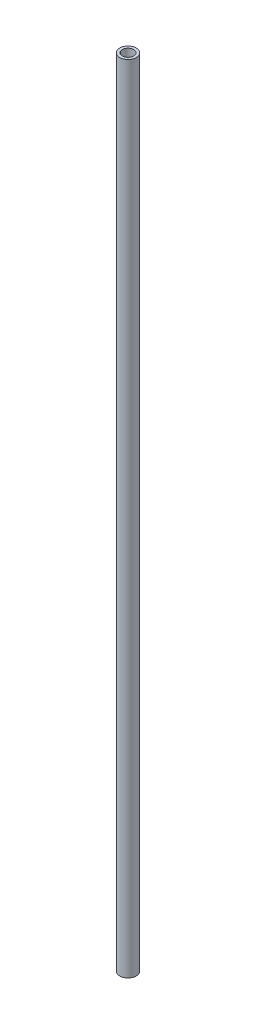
ISO-10303-21;
HEADER;
FILE_DESCRIPTION(('STEP AP214'),'2;1');
FILE_NAME('part.step','',(''),(''),'','','');
FILE_SCHEMA(('AUTOMOTIVE_DESIGN { 1 0 10303 214 1 1 1 1 }'));
ENDSEC;
DATA;
#1=APPLICATION_CONTEXT('core data for automotive mechanical design processes');
#2=APPLICATION_PROTOCOL_DEFINITION('international standard','automotive_design',2000,#1);
#3=PRODUCT_CONTEXT('',#1,'mechanical');
#4=PRODUCT('Part','Part','',(#3));
#5=PRODUCT_RELATED_PRODUCT_CATEGORY('part','',(#4));
#6=PRODUCT_DEFINITION_FORMATION('','',#4);
#7=PRODUCT_DEFINITION_CONTEXT('part definition',#1,'design');
#8=PRODUCT_DEFINITION('design','',#6,#7);
#9=PRODUCT_DEFINITION_SHAPE('','',#8);
#10=(LENGTH_UNIT() NAMED_UNIT(*) SI_UNIT(.MILLI.,.METRE.));
#11=(NAMED_UNIT(*) PLANE_ANGLE_UNIT() SI_UNIT($,.RADIAN.));
#12=(NAMED_UNIT(*) SI_UNIT($,.STERADIAN.) SOLID_ANGLE_UNIT());
#13=UNCERTAINTY_MEASURE_WITH_UNIT(LENGTH_MEASURE(1.E-05),#10,'distance_accuracy_value','');
#14=(GEOMETRIC_REPRESENTATION_CONTEXT(3) GLOBAL_UNCERTAINTY_ASSIGNED_CONTEXT((#13)) GLOBAL_UNIT_ASSIGNED_CONTEXT((#10,
#11,#12)) REPRESENTATION_CONTEXT('',''));
#15=CARTESIAN_POINT('',(0.,0.,0.));
#16=DIRECTION('',(0.,0.,1.));
#17=DIRECTION('',(1.,0.,0.));
#18=AXIS2_PLACEMENT_3D('',#15,#16,#17);
#19=CARTESIAN_POINT('',(0.,304.8,0.));
#20=DIRECTION('',(0.,1.,0.));
#21=DIRECTION('',(0.,0.,1.));
#22=AXIS2_PLACEMENT_3D('',#19,#20,#21);
#23=PLANE('',#22);
#24=CARTESIAN_POINT('',(0.,304.8,0.));
#25=DIRECTION('',(0.,1.,0.));
#26=DIRECTION('',(0.,0.,1.));
#27=AXIS2_PLACEMENT_3D('',#24,#25,#26);
#28=CIRCLE('',#27,3.17499999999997);
#29=CARTESIAN_POINT('',(0.,304.8,-3.17499999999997));
#30=VERTEX_POINT('',#29);
#31=EDGE_CURVE('E10',#30,#30,#28,.T.);
#32=ORIENTED_EDGE('',*,*,#31,.T.);
#33=EDGE_LOOP('',(#32));
#34=FACE_BOUND('',#33,.T.);
#35=CARTESIAN_POINT('',(0.,304.8,0.));
#36=DIRECTION('',(0.,1.,0.));
#37=DIRECTION('',(0.,0.,1.));
#38=AXIS2_PLACEMENT_3D('',#35,#36,#37);
#39=CIRCLE('',#38,2.15900000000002);
#40=CARTESIAN_POINT('',(0.,304.8,-2.15900000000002));
#41=VERTEX_POINT('',#40);
#42=EDGE_CURVE('E41',#41,#41,#39,.T.);
#43=ORIENTED_EDGE('',*,*,#42,.F.);
#44=EDGE_LOOP('',(#43));
#45=FACE_BOUND('',#44,.T.);
#46=ADVANCED_FACE('F30',(#34,#45),#23,.T.);
#47=CARTESIAN_POINT('',(0.,0.,0.));
#48=DIRECTION('',(0.,1.,0.));
#49=DIRECTION('',(0.,0.,1.));
#50=AXIS2_PLACEMENT_3D('',#47,#48,#49);
#51=PLANE('',#50);
#52=CARTESIAN_POINT('',(0.,0.,0.));
#53=DIRECTION('',(0.,1.,0.));
#54=DIRECTION('',(0.,0.,1.));
#55=AXIS2_PLACEMENT_3D('',#52,#53,#54);
#56=CIRCLE('',#55,3.17499999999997);
#57=CARTESIAN_POINT('',(0.,0.,-3.17499999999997));
#58=VERTEX_POINT('',#57);
#59=EDGE_CURVE('E34',#58,#58,#56,.T.);
#60=ORIENTED_EDGE('',*,*,#59,.F.);
#61=EDGE_LOOP('',(#60));
#62=FACE_BOUND('',#61,.T.);
#63=CARTESIAN_POINT('',(0.,0.,0.));
#64=DIRECTION('',(0.,1.,0.));
#65=DIRECTION('',(0.,0.,1.));
#66=AXIS2_PLACEMENT_3D('',#63,#64,#65);
#67=CIRCLE('',#66,2.15900000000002);
#68=CARTESIAN_POINT('',(0.,0.,-2.15900000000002));
#69=VERTEX_POINT('',#68);
#70=EDGE_CURVE('E43',#69,#69,#67,.T.);
#71=ORIENTED_EDGE('',*,*,#70,.T.);
#72=EDGE_LOOP('',(#71));
#73=FACE_BOUND('',#72,.T.);
#74=ADVANCED_FACE('F53',(#62,#73),#51,.F.);
#75=CARTESIAN_POINT('',(0.,304.8,0.));
#76=DIRECTION('',(0.,-1.,0.));
#77=DIRECTION('',(0.,0.,-1.));
#78=AXIS2_PLACEMENT_3D('',#75,#76,#77);
#79=CYLINDRICAL_SURFACE('',#78,3.17499999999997);
#80=CARTESIAN_POINT('',(0.,304.8,-3.17499999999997));
#81=CARTESIAN_POINT('',(0.,301.625,-3.17499999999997));
#82=CARTESIAN_POINT('',(0.,298.45,-3.17499999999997));
#83=CARTESIAN_POINT('',(0.,292.1,-3.17499999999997));
#84=CARTESIAN_POINT('',(0.,288.925,-3.17499999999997));
#85=CARTESIAN_POINT('',(0.,282.575,-3.17499999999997));
#86=CARTESIAN_POINT('',(0.,279.4,-3.17499999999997));
#87=CARTESIAN_POINT('',(0.,273.05,-3.17499999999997));
#88=CARTESIAN_POINT('',(0.,269.875,-3.17499999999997));
#89=CARTESIAN_POINT('',(0.,263.525,-3.17499999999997));
#90=CARTESIAN_POINT('',(0.,260.35,-3.17499999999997));
#91=CARTESIAN_POINT('',(0.,254.,-3.17499999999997));
#92=CARTESIAN_POINT('',(0.,250.825,-3.17499999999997));
#93=CARTESIAN_POINT('',(0.,244.475,-3.17499999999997));
#94=CARTESIAN_POINT('',(0.,241.3,-3.17499999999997));
#95=CARTESIAN_POINT('',(0.,234.95,-3.17499999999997));
#96=CARTESIAN_POINT('',(0.,231.775,-3.17499999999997));
#97=CARTESIAN_POINT('',(0.,225.425,-3.17499999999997));
#98=CARTESIAN_POINT('',(0.,222.25,-3.17499999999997));
#99=CARTESIAN_POINT('',(0.,215.9,-3.17499999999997));
#100=CARTESIAN_POINT('',(0.,212.725,-3.17499999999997));
#101=CARTESIAN_POINT('',(0.,206.375,-3.17499999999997));
#102=CARTESIAN_POINT('',(0.,203.2,-3.17499999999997));
#103=CARTESIAN_POINT('',(0.,196.85,-3.17499999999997));
#104=CARTESIAN_POINT('',(0.,193.675,-3.17499999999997));
#105=CARTESIAN_POINT('',(0.,187.325,-3.17499999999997));
#106=CARTESIAN_POINT('',(0.,184.15,-3.17499999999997));
#107=CARTESIAN_POINT('',(0.,177.8,-3.17499999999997));
#108=CARTESIAN_POINT('',(0.,174.625,-3.17499999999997));
#109=CARTESIAN_POINT('',(0.,168.275,-3.17499999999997));
#110=CARTESIAN_POINT('',(0.,165.1,-3.17499999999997));
#111=CARTESIAN_POINT('',(0.,158.75,-3.17499999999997));
#112=CARTESIAN_POINT('',(0.,155.575,-3.17499999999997));
#113=CARTESIAN_POINT('',(0.,149.225,-3.17499999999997));
#114=CARTESIAN_POINT('',(0.,146.05,-3.17499999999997));
#115=CARTESIAN_POINT('',(0.,139.7,-3.17499999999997));
#116=CARTESIAN_POINT('',(0.,136.525,-3.17499999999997));
#117=CARTESIAN_POINT('',(0.,130.175,-3.17499999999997));
#118=CARTESIAN_POINT('',(0.,127.,-3.17499999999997));
#119=CARTESIAN_POINT('',(0.,120.65,-3.17499999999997));
#120=CARTESIAN_POINT('',(0.,117.475,-3.17499999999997));
#121=CARTESIAN_POINT('',(0.,111.125,-3.17499999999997));
#122=CARTESIAN_POINT('',(0.,107.95,-3.17499999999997));
#123=CARTESIAN_POINT('',(0.,101.6,-3.17499999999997));
#124=CARTESIAN_POINT('',(0.,98.425,-3.17499999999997));
#125=CARTESIAN_POINT('',(0.,92.075,-3.17499999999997));
#126=CARTESIAN_POINT('',(0.,88.9,-3.17499999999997));
#127=CARTESIAN_POINT('',(0.,82.55,-3.17499999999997));
#128=CARTESIAN_POINT('',(0.,79.375,-3.17499999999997));
#129=CARTESIAN_POINT('',(0.,73.025,-3.17499999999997));
#130=CARTESIAN_POINT('',(0.,69.85,-3.17499999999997));
#131=CARTESIAN_POINT('',(0.,63.5,-3.17499999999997));
#132=CARTESIAN_POINT('',(0.,60.325,-3.17499999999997));
#133=CARTESIAN_POINT('',(0.,53.975,-3.17499999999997));
#134=CARTESIAN_POINT('',(0.,50.8,-3.17499999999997));
#135=CARTESIAN_POINT('',(0.,44.45,-3.17499999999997));
#136=CARTESIAN_POINT('',(0.,41.275,-3.17499999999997));
#137=CARTESIAN_POINT('',(0.,34.925,-3.17499999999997));
#138=CARTESIAN_POINT('',(0.,31.75,-3.17499999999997));
#139=CARTESIAN_POINT('',(0.,25.4,-3.17499999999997));
#140=CARTESIAN_POINT('',(0.,22.225,-3.17499999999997));
#141=CARTESIAN_POINT('',(0.,15.875,-3.17499999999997));
#142=CARTESIAN_POINT('',(0.,12.7,-3.17499999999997));
#143=CARTESIAN_POINT('',(0.,6.35,-3.17499999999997));
#144=CARTESIAN_POINT('',(0.,3.175,-3.17499999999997));
#145=CARTESIAN_POINT('',(0.,0.,-3.17499999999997));
#146=B_SPLINE_CURVE_WITH_KNOTS('',3,(#80,#81,#82,#83,#84,#85,#86,#87,#88,#89,#90,#91,#92,#93,
#94,#95,#96,#97,#98,#99,#100,#101,#102,#103,#104,#105,#106,#107,#108,#109,#110,#111,#112,#113,
#114,#115,#116,#117,#118,#119,#120,#121,#122,#123,#124,#125,#126,#127,#128,#129,#130,#131,#132,
#133,#134,#135,#136,#137,#138,#139,#140,#141,#142,#143,#144,#145),.UNSPECIFIED.,.F.,.F.,(4,2,2,
2,2,2,2,2,2,2,2,2,2,2,2,2,2,2,2,2,2,2,2,2,2,2,2,2,2,2,2,2,4),(0.,9.52499999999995,19.05,28.575,
38.1,47.625,57.15,66.675,76.2,85.725,95.2499999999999,104.775,114.3,123.825,133.35,142.875,
152.4,161.925,171.45,180.975,190.5,200.025,209.55,219.075,228.6,238.125,247.65,257.175,266.7,
276.225,285.75,295.275,304.8),.UNSPECIFIED.);
#147=EDGE_CURVE('BSEAM32',#30,#58,#146,.T.);
#148=ORIENTED_EDGE('',*,*,#31,.F.);
#149=ORIENTED_EDGE('',*,*,#59,.T.);
#150=ORIENTED_EDGE('',*,*,#147,.T.);
#151=ORIENTED_EDGE('',*,*,#147,.F.);
#152=EDGE_LOOP('',(#148,#150,#149,#151));
#153=FACE_BOUND('',#152,.T.);
#154=ADVANCED_FACE('F32',(#153),#79,.T.);
#155=CARTESIAN_POINT('',(0.,304.8,0.));
#156=DIRECTION('',(0.,-1.,0.));
#157=DIRECTION('',(0.,0.,-1.));
#158=AXIS2_PLACEMENT_3D('',#155,#156,#157);
#159=CYLINDRICAL_SURFACE('',#158,2.15900000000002);
#160=CARTESIAN_POINT('',(0.,304.8,-2.15900000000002));
#161=CARTESIAN_POINT('',(0.,301.625,-2.15900000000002));
#162=CARTESIAN_POINT('',(0.,298.45,-2.15900000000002));
#163=CARTESIAN_POINT('',(0.,292.1,-2.15900000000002));
#164=CARTESIAN_POINT('',(0.,288.925,-2.15900000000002));
#165=CARTESIAN_POINT('',(0.,282.575,-2.15900000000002));
#166=CARTESIAN_POINT('',(0.,279.4,-2.15900000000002));
#167=CARTESIAN_POINT('',(0.,273.05,-2.15900000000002));
#168=CARTESIAN_POINT('',(0.,269.875,-2.15900000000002));
#169=CARTESIAN_POINT('',(0.,263.525,-2.15900000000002));
#170=CARTESIAN_POINT('',(0.,260.35,-2.15900000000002));
#171=CARTESIAN_POINT('',(0.,254.,-2.15900000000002));
#172=CARTESIAN_POINT('',(0.,250.825,-2.15900000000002));
#173=CARTESIAN_POINT('',(0.,244.475,-2.15900000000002));
#174=CARTESIAN_POINT('',(0.,241.3,-2.15900000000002));
#175=CARTESIAN_POINT('',(0.,234.95,-2.15900000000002));
#176=CARTESIAN_POINT('',(0.,231.775,-2.15900000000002));
#177=CARTESIAN_POINT('',(0.,225.425,-2.15900000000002));
#178=CARTESIAN_POINT('',(0.,222.25,-2.15900000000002));
#179=CARTESIAN_POINT('',(0.,215.9,-2.15900000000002));
#180=CARTESIAN_POINT('',(0.,212.725,-2.15900000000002));
#181=CARTESIAN_POINT('',(0.,206.375,-2.15900000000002));
#182=CARTESIAN_POINT('',(0.,203.2,-2.15900000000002));
#183=CARTESIAN_POINT('',(0.,196.85,-2.15900000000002));
#184=CARTESIAN_POINT('',(0.,193.675,-2.15900000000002));
#185=CARTESIAN_POINT('',(0.,187.325,-2.15900000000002));
#186=CARTESIAN_POINT('',(0.,184.15,-2.15900000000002));
#187=CARTESIAN_POINT('',(0.,177.8,-2.15900000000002));
#188=CARTESIAN_POINT('',(0.,174.625,-2.15900000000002));
#189=CARTESIAN_POINT('',(0.,168.275,-2.15900000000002));
#190=CARTESIAN_POINT('',(0.,165.1,-2.15900000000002));
#191=CARTESIAN_POINT('',(0.,158.75,-2.15900000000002));
#192=CARTESIAN_POINT('',(0.,155.575,-2.15900000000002));
#193=CARTESIAN_POINT('',(0.,149.225,-2.15900000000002));
#194=CARTESIAN_POINT('',(0.,146.05,-2.15900000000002));
#195=CARTESIAN_POINT('',(0.,139.7,-2.15900000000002));
#196=CARTESIAN_POINT('',(0.,136.525,-2.15900000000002));
#197=CARTESIAN_POINT('',(0.,130.175,-2.15900000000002));
#198=CARTESIAN_POINT('',(0.,127.,-2.15900000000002));
#199=CARTESIAN_POINT('',(0.,120.65,-2.15900000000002));
#200=CARTESIAN_POINT('',(0.,117.475,-2.15900000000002));
#201=CARTESIAN_POINT('',(0.,111.125,-2.15900000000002));
#202=CARTESIAN_POINT('',(0.,107.95,-2.15900000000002));
#203=CARTESIAN_POINT('',(0.,101.6,-2.15900000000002));
#204=CARTESIAN_POINT('',(0.,98.425,-2.15900000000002));
#205=CARTESIAN_POINT('',(0.,92.075,-2.15900000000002));
#206=CARTESIAN_POINT('',(0.,88.9,-2.15900000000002));
#207=CARTESIAN_POINT('',(0.,82.55,-2.15900000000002));
#208=CARTESIAN_POINT('',(0.,79.375,-2.15900000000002));
#209=CARTESIAN_POINT('',(0.,73.025,-2.15900000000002));
#210=CARTESIAN_POINT('',(0.,69.85,-2.15900000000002));
#211=CARTESIAN_POINT('',(0.,63.5,-2.15900000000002));
#212=CARTESIAN_POINT('',(0.,60.325,-2.15900000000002));
#213=CARTESIAN_POINT('',(0.,53.975,-2.15900000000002));
#214=CARTESIAN_POINT('',(0.,50.8,-2.15900000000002));
#215=CARTESIAN_POINT('',(0.,44.45,-2.15900000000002));
#216=CARTESIAN_POINT('',(0.,41.275,-2.15900000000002));
#217=CARTESIAN_POINT('',(0.,34.925,-2.15900000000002));
#218=CARTESIAN_POINT('',(0.,31.75,-2.15900000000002));
#219=CARTESIAN_POINT('',(0.,25.4,-2.15900000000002));
#220=CARTESIAN_POINT('',(0.,22.225,-2.15900000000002));
#221=CARTESIAN_POINT('',(0.,15.875,-2.15900000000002));
#222=CARTESIAN_POINT('',(0.,12.7,-2.15900000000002));
#223=CARTESIAN_POINT('',(0.,6.35,-2.15900000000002));
#224=CARTESIAN_POINT('',(0.,3.175,-2.15900000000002));
#225=CARTESIAN_POINT('',(0.,0.,-2.15900000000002));
#226=B_SPLINE_CURVE_WITH_KNOTS('',3,(#160,#161,#162,#163,#164,#165,#166,#167,#168,#169,#170,
#171,#172,#173,#174,#175,#176,#177,#178,#179,#180,#181,#182,#183,#184,#185,#186,#187,#188,#189,
#190,#191,#192,#193,#194,#195,#196,#197,#198,#199,#200,#201,#202,#203,#204,#205,#206,#207,#208,
#209,#210,#211,#212,#213,#214,#215,#216,#217,#218,#219,#220,#221,#222,#223,#224,#225),
.UNSPECIFIED.,.F.,.F.,(4,2,2,2,2,2,2,2,2,2,2,2,2,2,2,2,2,2,2,2,2,2,2,2,2,2,2,2,2,2,2,2,4),(0.,
9.52499999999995,19.05,28.575,38.1,47.625,57.15,66.675,76.2,85.725,95.2499999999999,104.775,
114.3,123.825,133.35,142.875,152.4,161.925,171.45,180.975,190.5,200.025,209.55,219.075,228.6,
238.125,247.65,257.175,266.7,276.225,285.75,295.275,304.8),.UNSPECIFIED.);
#227=EDGE_CURVE('BSEAM49',#41,#69,#226,.T.);
#228=ORIENTED_EDGE('',*,*,#42,.T.);
#229=ORIENTED_EDGE('',*,*,#70,.F.);
#230=ORIENTED_EDGE('',*,*,#227,.T.);
#231=ORIENTED_EDGE('',*,*,#227,.F.);
#232=EDGE_LOOP('',(#228,#230,#229,#231));
#233=FACE_BOUND('',#232,.T.);
#234=ADVANCED_FACE('F49',(#233),#159,.F.);
#235=CLOSED_SHELL('',(#46,#74,#154,#234));
#236=MANIFOLD_SOLID_BREP('B2',#235);
#237=ADVANCED_BREP_SHAPE_REPRESENTATION('',(#18,#236),#14);
#238=SHAPE_DEFINITION_REPRESENTATION(#9,#237);
ENDSEC;
END-ISO-10303-21;
